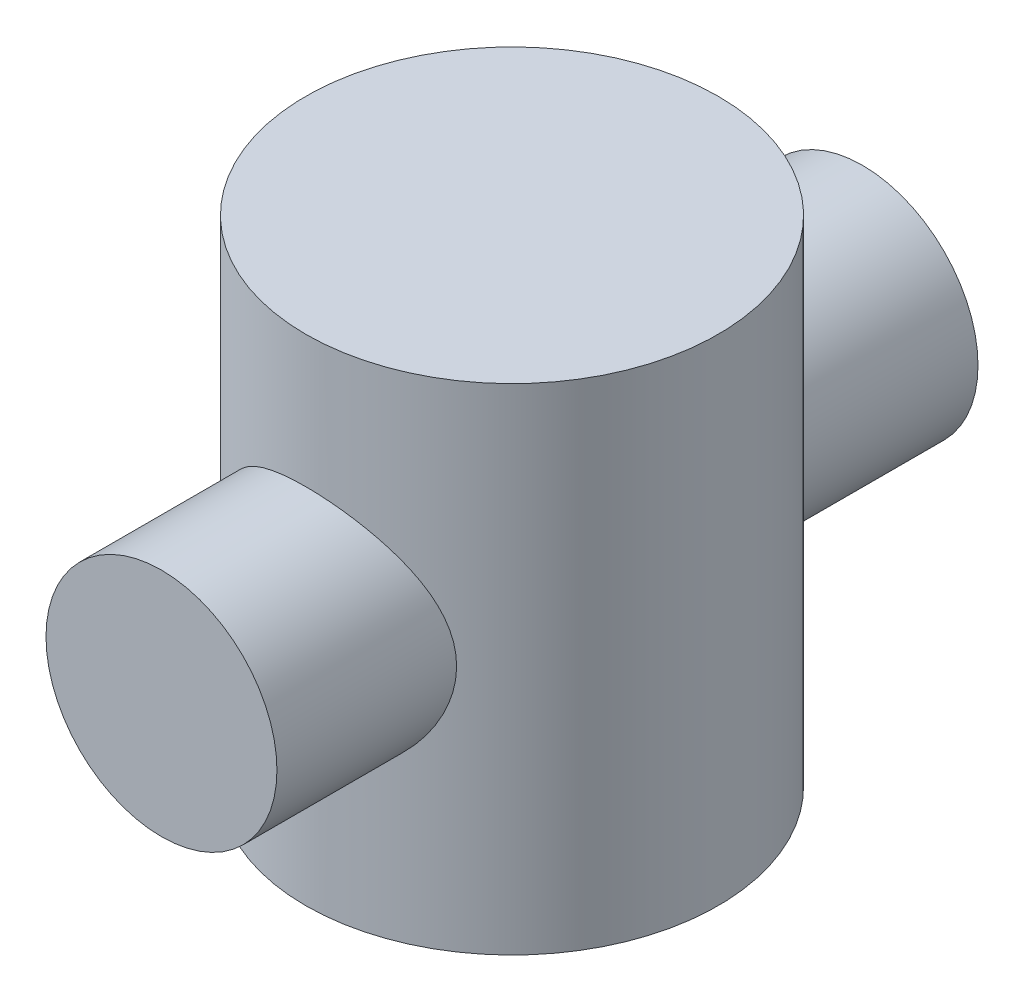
ISO-10303-21;
HEADER;
FILE_DESCRIPTION(('STEP AP214'),'2;1');
FILE_NAME('part.step','',(''),(''),'','','');
FILE_SCHEMA(('AUTOMOTIVE_DESIGN { 1 0 10303 214 1 1 1 1 }'));
ENDSEC;
DATA;
#1=APPLICATION_CONTEXT('core data for automotive mechanical design processes');
#2=APPLICATION_PROTOCOL_DEFINITION('international standard','automotive_design',2000,#1);
#3=PRODUCT_CONTEXT('',#1,'mechanical');
#4=PRODUCT('Part','Part','',(#3));
#5=PRODUCT_RELATED_PRODUCT_CATEGORY('part','',(#4));
#6=PRODUCT_DEFINITION_FORMATION('','',#4);
#7=PRODUCT_DEFINITION_CONTEXT('part definition',#1,'design');
#8=PRODUCT_DEFINITION('design','',#6,#7);
#9=PRODUCT_DEFINITION_SHAPE('','',#8);
#10=(LENGTH_UNIT() NAMED_UNIT(*) SI_UNIT(.MILLI.,.METRE.));
#11=(NAMED_UNIT(*) PLANE_ANGLE_UNIT() SI_UNIT($,.RADIAN.));
#12=(NAMED_UNIT(*) SI_UNIT($,.STERADIAN.) SOLID_ANGLE_UNIT());
#13=UNCERTAINTY_MEASURE_WITH_UNIT(LENGTH_MEASURE(1.E-05),#10,'distance_accuracy_value','');
#14=(GEOMETRIC_REPRESENTATION_CONTEXT(3) GLOBAL_UNCERTAINTY_ASSIGNED_CONTEXT((#13)) GLOBAL_UNIT_ASSIGNED_CONTEXT((#10,
#11,#12)) REPRESENTATION_CONTEXT('',''));
#15=CARTESIAN_POINT('',(0.,0.,0.));
#16=DIRECTION('',(0.,0.,1.));
#17=DIRECTION('',(1.,0.,0.));
#18=AXIS2_PLACEMENT_3D('',#15,#16,#17);
#19=CARTESIAN_POINT('',(0.,120.,0.));
#20=DIRECTION('',(0.,-1.,0.));
#21=DIRECTION('',(0.,0.,-1.));
#22=AXIS2_PLACEMENT_3D('',#19,#20,#21);
#23=CYLINDRICAL_SURFACE('',#22,50.);
#24=CARTESIAN_POINT('',(-28.,60.,41.424630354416));
#25=CARTESIAN_POINT('',(-27.9999924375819,59.2849118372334,41.4246407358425));
#26=CARTESIAN_POINT('',(-27.9725588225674,58.5696674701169,41.4432197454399));
#27=CARTESIAN_POINT('',(-27.8632461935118,57.1451396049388,41.5167879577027));
#28=CARTESIAN_POINT('',(-27.7813510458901,56.4358579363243,41.5717879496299));
#29=CARTESIAN_POINT('',(-27.5642480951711,55.0280623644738,41.7160542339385));
#30=CARTESIAN_POINT('',(-27.4289671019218,54.3295646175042,41.8053675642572));
#31=CARTESIAN_POINT('',(-27.1070201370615,52.9493467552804,42.0148334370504));
#32=CARTESIAN_POINT('',(-26.9203563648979,52.2676259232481,42.1349846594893));
#33=CARTESIAN_POINT('',(-26.499299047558,50.9293851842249,42.4010456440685));
#34=CARTESIAN_POINT('',(-26.2652244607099,50.2727300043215,42.5467824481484));
#35=CARTESIAN_POINT('',(-25.7509466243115,48.9831637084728,42.8599968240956));
#36=CARTESIAN_POINT('',(-25.4707430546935,48.3502527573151,43.0274745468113));
#37=CARTESIAN_POINT('',(-24.8664521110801,47.1106604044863,43.3795088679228));
#38=CARTESIAN_POINT('',(-24.5423608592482,46.5039813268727,43.5640669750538));
#39=CARTESIAN_POINT('',(-23.8524088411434,45.3189665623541,43.9456254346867));
#40=CARTESIAN_POINT('',(-23.4865457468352,44.7406324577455,44.1426264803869));
#41=CARTESIAN_POINT('',(-22.6743775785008,43.5548835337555,44.5657228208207));
#42=CARTESIAN_POINT('',(-22.2236593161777,42.9508022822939,44.792699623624));
#43=CARTESIAN_POINT('',(-21.2758566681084,41.7817607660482,45.2505794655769));
#44=CARTESIAN_POINT('',(-20.7787698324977,41.2168025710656,45.4814827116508));
#45=CARTESIAN_POINT('',(-19.7400942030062,40.1280340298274,45.9418275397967));
#46=CARTESIAN_POINT('',(-19.1984795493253,39.6042479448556,46.1712681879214));
#47=CARTESIAN_POINT('',(-18.0731575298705,38.6007156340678,46.623263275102));
#48=CARTESIAN_POINT('',(-17.4894484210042,38.1209712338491,46.8458174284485));
#49=CARTESIAN_POINT('',(-16.227780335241,37.1671385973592,47.2984962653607));
#50=CARTESIAN_POINT('',(-15.5460687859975,36.6974611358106,47.5274940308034));
#51=CARTESIAN_POINT('',(-14.1388297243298,35.8177328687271,47.9649496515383));
#52=CARTESIAN_POINT('',(-13.4132988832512,35.4076866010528,48.1734059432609));
#53=CARTESIAN_POINT('',(-11.92320980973,34.6517354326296,48.5636672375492));
#54=CARTESIAN_POINT('',(-11.1586754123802,34.3057919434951,48.7454882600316));
#55=CARTESIAN_POINT('',(-9.59559650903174,33.6820921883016,49.0771072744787));
#56=CARTESIAN_POINT('',(-8.79705674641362,33.4043264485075,49.2269097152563));
#57=CARTESIAN_POINT('',(-7.24208156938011,32.9416775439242,49.4784648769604));
#58=CARTESIAN_POINT('',(-6.4878919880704,32.7508795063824,49.5832327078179));
#59=CARTESIAN_POINT('',(-4.96243965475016,32.4322443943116,49.759053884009));
#60=CARTESIAN_POINT('',(-4.19117779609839,32.3044040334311,49.8301089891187));
#61=CARTESIAN_POINT('',(-2.63872833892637,32.1136530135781,49.9363802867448));
#62=CARTESIAN_POINT('',(-1.85754767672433,32.0506992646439,49.9716202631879));
#63=CARTESIAN_POINT('',(-0.291891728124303,31.9905667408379,50.0052766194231));
#64=CARTESIAN_POINT('',(0.492583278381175,31.9933824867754,50.0036960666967));
#65=CARTESIAN_POINT('',(1.97250673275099,32.0608355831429,49.9659517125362));
#66=CARTESIAN_POINT('',(2.66837180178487,32.118726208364,49.9335621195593));
#67=CARTESIAN_POINT('',(4.05190722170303,32.2859695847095,49.8403715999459));
#68=CARTESIAN_POINT('',(4.73957829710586,32.3953177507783,49.7795732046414));
#69=CARTESIAN_POINT('',(6.10206482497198,32.6641801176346,49.630983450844));
#70=CARTESIAN_POINT('',(6.77687980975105,32.8236961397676,49.5431911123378));
#71=CARTESIAN_POINT('',(8.10938655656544,33.1911292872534,49.3425969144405));
#72=CARTESIAN_POINT('',(8.76707764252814,33.3990483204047,49.2297940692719));
#73=CARTESIAN_POINT('',(10.0679294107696,33.8634644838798,48.9804016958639));
#74=CARTESIAN_POINT('',(10.7108835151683,34.1204193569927,48.843589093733));
#75=CARTESIAN_POINT('',(11.9721685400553,34.6791983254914,48.5498354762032));
#76=CARTESIAN_POINT('',(12.5904995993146,34.9810221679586,48.3928945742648));
#77=CARTESIAN_POINT('',(13.7998974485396,35.6272078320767,48.0620013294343));
#78=CARTESIAN_POINT('',(14.3909588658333,35.9715779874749,47.8880456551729));
#79=CARTESIAN_POINT('',(15.5433943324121,36.7004757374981,47.5264946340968));
#80=CARTESIAN_POINT('',(16.1047665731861,37.0850057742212,47.3388984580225));
#81=CARTESIAN_POINT('',(17.2560858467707,37.9365646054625,46.9322932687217));
#82=CARTESIAN_POINT('',(17.8423493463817,38.4080146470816,46.7121023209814));
#83=CARTESIAN_POINT('',(18.9735087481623,39.3949168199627,46.2641989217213));
#84=CARTESIAN_POINT('',(19.5184020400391,39.9103717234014,46.036485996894));
#85=CARTESIAN_POINT('',(20.5651976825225,40.9832984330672,45.5784965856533));
#86=CARTESIAN_POINT('',(21.0670557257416,41.5408124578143,45.3482177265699));
#87=CARTESIAN_POINT('',(22.0250305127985,42.6950699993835,44.890754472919));
#88=CARTESIAN_POINT('',(22.4811450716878,43.2918153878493,44.6635702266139));
#89=CARTESIAN_POINT('',(23.3856892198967,44.5797171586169,44.1971948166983));
#90=CARTESIAN_POINT('',(23.8294329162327,45.2744877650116,43.9588605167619));
#91=CARTESIAN_POINT('',(24.6562258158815,46.70514647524,43.5005066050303));
#92=CARTESIAN_POINT('',(25.0392696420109,47.4410382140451,43.2804886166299));
#93=CARTESIAN_POINT('',(25.7405735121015,48.9494821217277,42.8671029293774));
#94=CARTESIAN_POINT('',(26.0588928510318,49.7219999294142,42.6737108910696));
#95=CARTESIAN_POINT('',(26.6271043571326,51.2994411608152,42.3214989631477));
#96=CARTESIAN_POINT('',(26.877007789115,52.1043592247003,42.1626733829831));
#97=CARTESIAN_POINT('',(27.2873093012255,53.674834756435,41.8981805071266));
#98=CARTESIAN_POINT('',(27.4532671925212,54.4383918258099,41.7892777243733));
#99=CARTESIAN_POINT('',(27.7211704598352,55.9813456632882,41.6120497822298));
#100=CARTESIAN_POINT('',(27.823120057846,56.7607413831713,41.5437219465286));
#101=CARTESIAN_POINT('',(27.9610257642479,58.3271230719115,41.4510313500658));
#102=CARTESIAN_POINT('',(27.9970531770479,59.1140999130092,41.4266210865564));
#103=CARTESIAN_POINT('',(28.0025983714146,60.6883488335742,41.4228751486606));
#104=CARTESIAN_POINT('',(27.9721241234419,61.4756208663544,41.4435340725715));
#105=CARTESIAN_POINT('',(27.8550742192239,62.9219206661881,41.522267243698));
#106=CARTESIAN_POINT('',(27.7778336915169,63.5820744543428,41.5741077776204));
#107=CARTESIAN_POINT('',(27.5772600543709,64.8922158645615,41.7074243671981));
#108=CARTESIAN_POINT('',(27.4539327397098,65.5422047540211,41.7888966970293));
#109=CARTESIAN_POINT('',(27.1626465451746,66.8282951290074,41.9788134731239));
#110=CARTESIAN_POINT('',(26.9946704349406,67.4643911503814,42.087268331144));
#111=CARTESIAN_POINT('',(26.6159075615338,68.7191167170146,42.3278128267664));
#112=CARTESIAN_POINT('',(26.4051177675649,69.3377450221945,42.4599041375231));
#113=CARTESIAN_POINT('',(25.9333253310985,70.5792844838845,42.7497636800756));
#114=CARTESIAN_POINT('',(25.6706417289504,71.2013639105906,42.9083520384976));
#115=CARTESIAN_POINT('',(25.103122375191,72.4211863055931,43.2428225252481));
#116=CARTESIAN_POINT('',(24.7982820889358,73.0189266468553,43.4187065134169));
#117=CARTESIAN_POINT('',(24.1483547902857,74.1881815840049,43.7835109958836));
#118=CARTESIAN_POINT('',(23.803255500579,74.7596881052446,43.9724354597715));
#119=CARTESIAN_POINT('',(23.0746882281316,75.8745801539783,44.3590900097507));
#120=CARTESIAN_POINT('',(22.6912173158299,76.4179635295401,44.5568207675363));
#121=CARTESIAN_POINT('',(21.8209988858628,77.5625408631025,44.9901953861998));
#122=CARTESIAN_POINT('',(21.327663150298,78.1584154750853,45.2266971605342));
#123=CARTESIAN_POINT('',(20.2934847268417,79.3073028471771,45.7000868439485));
#124=CARTESIAN_POINT('',(19.7526376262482,79.8603116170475,45.9369747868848));
#125=CARTESIAN_POINT('',(18.6254176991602,80.921116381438,46.4054578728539));
#126=CARTESIAN_POINT('',(18.0390164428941,81.4288837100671,46.6370495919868));
#127=CARTESIAN_POINT('',(16.8234428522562,82.3958687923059,47.0891950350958));
#128=CARTESIAN_POINT('',(16.194270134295,82.8550861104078,47.3097486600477));
#129=CARTESIAN_POINT('',(14.859091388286,83.7463160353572,47.746498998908));
#130=CARTESIAN_POINT('',(14.1507518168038,84.1753124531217,47.9617406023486));
#131=CARTESIAN_POINT('',(12.6933096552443,84.97136966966,48.3678828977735));
#132=CARTESIAN_POINT('',(11.9442046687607,85.3384268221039,48.5587821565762));
#133=CARTESIAN_POINT('',(10.410843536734,86.0060161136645,48.9104530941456));
#134=CARTESIAN_POINT('',(9.62661825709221,86.3066053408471,49.071250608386));
#135=CARTESIAN_POINT('',(8.02854884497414,86.8374919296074,49.3578867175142));
#136=CARTESIAN_POINT('',(7.21470931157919,87.0678001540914,49.4837307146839));
#137=CARTESIAN_POINT('',(5.65004793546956,87.4345453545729,49.6853439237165));
#138=CARTESIAN_POINT('',(4.90141206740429,87.5782266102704,49.7649455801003));
#139=CARTESIAN_POINT('',(3.39214477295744,87.8042337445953,49.890545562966));
#140=CARTESIAN_POINT('',(2.63151418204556,87.8865638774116,49.9365462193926));
#141=CARTESIAN_POINT('',(1.10512348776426,87.9886322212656,49.9936170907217));
#142=CARTESIAN_POINT('',(0.339366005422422,88.0084002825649,50.0047039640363));
#143=CARTESIAN_POINT('',(-1.19087214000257,87.9851255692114,49.9916706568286));
#144=CARTESIAN_POINT('',(-1.95535287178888,87.9420862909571,49.9675524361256));
#145=CARTESIAN_POINT('',(-3.40431771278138,87.8008874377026,49.8887396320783));
#146=CARTESIAN_POINT('',(-4.0895270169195,87.7083284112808,49.837153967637));
#147=CARTESIAN_POINT('',(-5.4486774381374,87.4733955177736,49.706919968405));
#148=CARTESIAN_POINT('',(-6.12261944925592,87.3310256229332,49.6282737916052));
#149=CARTESIAN_POINT('',(-7.4549813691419,86.9980527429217,49.4456822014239));
#150=CARTESIAN_POINT('',(-8.11340040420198,86.8074470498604,49.3417353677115));
#151=CARTESIAN_POINT('',(-9.41087584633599,86.3799550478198,49.1107899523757));
#152=CARTESIAN_POINT('',(-10.049931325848,86.1430665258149,48.9837902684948));
#153=CARTESIAN_POINT('',(-11.3252270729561,85.6169862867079,48.7050167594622));
#154=CARTESIAN_POINT('',(-11.9607376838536,85.3263761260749,48.5525858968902));
#155=CARTESIAN_POINT('',(-13.2045314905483,84.7007088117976,48.2291749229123));
#156=CARTESIAN_POINT('',(-13.8128144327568,84.3656512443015,48.0581946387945));
#157=CARTESIAN_POINT('',(-14.9997374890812,83.6534788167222,47.7010704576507));
#158=CARTESIAN_POINT('',(-15.5783700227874,83.2763532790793,47.5149227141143));
#159=CARTESIAN_POINT('',(-16.7037856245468,82.4823882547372,47.1310620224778));
#160=CARTESIAN_POINT('',(-17.2505658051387,82.0655451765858,46.9333480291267));
#161=CARTESIAN_POINT('',(-18.076498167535,81.3866124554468,46.6191021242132));
#162=CARTESIAN_POINT('',(-18.3673217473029,81.1373586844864,46.5052266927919));
#163=CARTESIAN_POINT('',(-18.9380616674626,80.6275592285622,46.2757431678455));
#164=CARTESIAN_POINT('',(-19.217980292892,80.3670159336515,46.1601354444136));
#165=CARTESIAN_POINT('',(-20.0411166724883,79.5687992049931,45.8116639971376));
#166=CARTESIAN_POINT('',(-20.5677234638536,79.01453190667,45.5771487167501));
#167=CARTESIAN_POINT('',(-21.5747186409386,77.8638435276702,45.1092040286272));
#168=CARTESIAN_POINT('',(-22.0550487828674,77.2673709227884,44.8757763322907));
#169=CARTESIAN_POINT('',(-22.966475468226,76.0352168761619,44.4162297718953));
#170=CARTESIAN_POINT('',(-23.3975713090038,75.3995348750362,44.1901110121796));
#171=CARTESIAN_POINT('',(-24.2380668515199,74.0427687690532,43.7351251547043));
#172=CARTESIAN_POINT('',(-24.6434713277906,73.3188489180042,43.5073033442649));
#173=CARTESIAN_POINT('',(-25.3908898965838,71.8319502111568,43.0753894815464));
#174=CARTESIAN_POINT('',(-25.7328928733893,71.0689645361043,42.8713015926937));
#175=CARTESIAN_POINT('',(-26.3485945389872,69.5106047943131,42.4956631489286));
#176=CARTESIAN_POINT('',(-26.6224744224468,68.7153233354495,42.3240265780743));
#177=CARTESIAN_POINT('',(-27.0988974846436,67.0965140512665,42.0205891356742));
#178=CARTESIAN_POINT('',(-27.3014849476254,66.2730041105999,41.8887635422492));
#179=CARTESIAN_POINT('',(-27.5547674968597,64.9941077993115,41.7222438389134));
#180=CARTESIAN_POINT('',(-27.6322521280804,64.5459975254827,41.670912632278));
#181=CARTESIAN_POINT('',(-27.7654401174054,63.6451985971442,41.5822896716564));
#182=CARTESIAN_POINT('',(-27.8211469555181,63.1925106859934,41.544995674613));
#183=CARTESIAN_POINT('',(-27.9104263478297,62.2839605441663,41.4850695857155));
#184=CARTESIAN_POINT('',(-27.943997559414,61.8280981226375,41.4624383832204));
#185=CARTESIAN_POINT('',(-27.9887858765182,60.9148450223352,41.4322160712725));
#186=CARTESIAN_POINT('',(-28.0000048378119,60.4574544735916,41.4246237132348));
#187=CARTESIAN_POINT('',(-28.,60.,41.424630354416));
#188=B_SPLINE_CURVE_WITH_KNOTS('',3,(#24,#25,#26,#27,#28,#29,#30,#31,#32,#33,#34,#35,#36,#37,
#38,#39,#40,#41,#42,#43,#44,#45,#46,#47,#48,#49,#50,#51,#52,#53,#54,#55,#56,#57,#58,#59,#60,#61,
#62,#63,#64,#65,#66,#67,#68,#69,#70,#71,#72,#73,#74,#75,#76,#77,#78,#79,#80,#81,#82,#83,#84,#85,
#86,#87,#88,#89,#90,#91,#92,#93,#94,#95,#96,#97,#98,#99,#100,#101,#102,#103,#104,#105,#106,#107,
#108,#109,#110,#111,#112,#113,#114,#115,#116,#117,#118,#119,#120,#121,#122,#123,#124,#125,#126,
#127,#128,#129,#130,#131,#132,#133,#134,#135,#136,#137,#138,#139,#140,#141,#142,#143,#144,#145,
#146,#147,#148,#149,#150,#151,#152,#153,#154,#155,#156,#157,#158,#159,#160,#161,#162,#163,#164,
#165,#166,#167,#168,#169,#170,#171,#172,#173,#174,#175,#176,#177,#178,#179,#180,#181,#182,#183,
#184,#185,#186,#187),.UNSPECIFIED.,.T.,.F.,(4,2,2,2,2,2,2,2,2,2,2,2,2,2,2,2,2,2,2,2,2,2,2,2,2,2,
2,2,2,2,2,2,2,2,2,2,2,2,2,2,2,2,2,2,2,2,2,2,2,2,2,2,2,2,2,2,2,2,2,2,2,2,2,2,2,2,2,2,2,2,2,2,2,2,
2,2,2,2,2,2,2,4),(0.,2.14477776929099,4.29019118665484,6.43855616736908,8.58682920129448,
10.7211029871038,12.8553915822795,14.9898688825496,17.124465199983,19.4834460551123,
21.84255161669,24.2030370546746,26.563620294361,29.1370607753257,31.7106969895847,
34.2827788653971,36.8545031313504,39.2061210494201,41.557616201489,43.9075487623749,
46.2572855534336,48.3518525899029,50.4462330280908,52.5406895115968,54.6352285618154,
56.7503715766,58.8655026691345,60.981048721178,63.0967234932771,65.4458821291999,
67.7951888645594,70.1468860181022,72.4986954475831,75.0698896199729,77.641311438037,
80.2103668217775,82.7789989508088,85.1422045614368,87.5052542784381,89.8657464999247,
92.2259558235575,94.2236739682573,96.2211410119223,98.2193800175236,100.217760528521,
102.296659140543,104.375781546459,106.455539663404,108.535456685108,110.959661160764,
113.384091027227,115.81004629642,118.2360233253,120.799472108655,123.363071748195,
125.92446093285,128.485454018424,130.781621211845,133.077629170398,135.372541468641,
137.667326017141,139.744987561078,141.82248345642,143.900096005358,145.977807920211,
148.121298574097,150.264809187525,152.408865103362,154.553115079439,155.751609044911,
156.949850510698,159.346298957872,161.745725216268,164.145185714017,166.723019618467,
169.301305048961,171.87265757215,174.442410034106,175.814712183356,177.186794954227,
178.558960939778,179.931012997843),.UNSPECIFIED.);
#189=CARTESIAN_POINT('',(-28.,60.,41.424630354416));
#190=VERTEX_POINT('',#189);
#191=EDGE_CURVE('E39',#190,#190,#188,.T.);
#192=ORIENTED_EDGE('',*,*,#191,.F.);
#193=EDGE_LOOP('',(#192));
#194=FACE_BOUND('',#193,.T.);
#195=CARTESIAN_POINT('',(0.,120.,0.));
#196=DIRECTION('',(0.,1.,0.));
#197=DIRECTION('',(0.,0.,1.));
#198=AXIS2_PLACEMENT_3D('',#195,#196,#197);
#199=CIRCLE('',#198,50.);
#200=CARTESIAN_POINT('',(0.,120.,50.));
#201=VERTEX_POINT('',#200);
#202=EDGE_CURVE('E43',#201,#201,#199,.T.);
#203=ORIENTED_EDGE('',*,*,#202,.F.);
#204=EDGE_LOOP('',(#203));
#205=FACE_BOUND('',#204,.T.);
#206=CARTESIAN_POINT('',(0.,0.,0.));
#207=DIRECTION('',(0.,1.,0.));
#208=DIRECTION('',(0.,0.,1.));
#209=AXIS2_PLACEMENT_3D('',#206,#207,#208);
#210=CIRCLE('',#209,50.);
#211=CARTESIAN_POINT('',(0.,0.,50.));
#212=VERTEX_POINT('',#211);
#213=EDGE_CURVE('E47',#212,#212,#210,.T.);
#214=ORIENTED_EDGE('',*,*,#213,.T.);
#215=EDGE_LOOP('',(#214));
#216=FACE_BOUND('',#215,.T.);
#217=CARTESIAN_POINT('',(0.,88.,-50.));
#218=CARTESIAN_POINT('',(0.725789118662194,88.0000033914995,-50.0000029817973));
#219=CARTESIAN_POINT('',(1.45153575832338,87.9717506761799,-49.9841642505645));
#220=CARTESIAN_POINT('',(2.89724829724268,87.8591375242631,-49.921231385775));
#221=CARTESIAN_POINT('',(3.61721463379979,87.7747813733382,-49.8741396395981));
#222=CARTESIAN_POINT('',(5.04594931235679,87.5510678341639,-49.7499015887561));
#223=CARTESIAN_POINT('',(5.75471665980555,87.4117055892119,-49.6727526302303));
#224=CARTESIAN_POINT('',(7.15594832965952,87.0797132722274,-49.4903187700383));
#225=CARTESIAN_POINT('',(7.84841217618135,86.8870816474,-49.3850330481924));
#226=CARTESIAN_POINT('',(9.20994156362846,86.4515776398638,-49.1492887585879));
#227=CARTESIAN_POINT('',(9.87908556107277,86.2088976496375,-49.0189267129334));
#228=CARTESIAN_POINT('',(11.1928842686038,85.6753204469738,-48.7357257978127));
#229=CARTESIAN_POINT('',(11.83753920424,85.3844236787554,-48.5828871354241));
#230=CARTESIAN_POINT('',(13.0992393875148,84.756947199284,-48.2579982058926));
#231=CARTESIAN_POINT('',(13.7162810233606,84.4203615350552,-48.0859454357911));
#232=CARTESIAN_POINT('',(14.9200130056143,83.7040882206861,-47.7261762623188));
#233=CARTESIAN_POINT('',(15.5067019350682,83.3243985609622,-47.5384591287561));
#234=CARTESIAN_POINT('',(16.6875519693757,82.4962562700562,-47.1374712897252));
#235=CARTESIAN_POINT('',(17.2793451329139,82.044847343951,-46.92333181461));
#236=CARTESIAN_POINT('',(18.4232468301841,81.0982277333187,-46.4861159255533));
#237=CARTESIAN_POINT('',(18.9753538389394,80.6030153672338,-46.2630391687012));
#238=CARTESIAN_POINT('',(20.0382856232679,79.570806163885,-45.8126684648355));
#239=CARTESIAN_POINT('',(20.5490700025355,79.0337694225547,-45.5853706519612));
#240=CARTESIAN_POINT('',(21.5267247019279,77.9206281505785,-45.1319237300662));
#241=CARTESIAN_POINT('',(21.993592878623,77.344521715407,-44.9057746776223));
#242=CARTESIAN_POINT('',(22.9272591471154,76.0938237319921,-44.4369345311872));
#243=CARTESIAN_POINT('',(23.3890459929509,75.4152109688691,-44.1949547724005));
#244=CARTESIAN_POINT('',(24.2534189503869,74.0159890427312,-43.7265757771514));
#245=CARTESIAN_POINT('',(24.6559971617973,73.2953742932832,-43.5001786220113));
#246=CARTESIAN_POINT('',(25.3978852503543,71.816552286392,-43.0712303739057));
#247=CARTESIAN_POINT('',(25.7372696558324,71.0583906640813,-42.8686512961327));
#248=CARTESIAN_POINT('',(26.3493584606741,69.5081640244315,-42.4951769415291));
#249=CARTESIAN_POINT('',(26.6220835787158,68.7161096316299,-42.3242718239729));
#250=CARTESIAN_POINT('',(27.0462355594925,67.275874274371,-42.0541328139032));
#251=CARTESIAN_POINT('',(27.2111271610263,66.633039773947,-41.9473870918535));
#252=CARTESIAN_POINT('',(27.4953896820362,65.3334557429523,-41.7616149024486));
#253=CARTESIAN_POINT('',(27.6147671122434,64.6767082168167,-41.6825844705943));
#254=CARTESIAN_POINT('',(27.8064171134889,63.3540040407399,-41.5549812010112));
#255=CARTESIAN_POINT('',(27.8787301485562,62.6880558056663,-41.5063822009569));
#256=CARTESIAN_POINT('',(27.975412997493,61.3510893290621,-41.4412801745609));
#257=CARTESIAN_POINT('',(27.999781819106,60.6800709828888,-41.4247778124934));
#258=CARTESIAN_POINT('',(28.0002155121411,59.3372353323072,-41.4244847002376));
#259=CARTESIAN_POINT('',(27.9762244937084,58.6654180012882,-41.4407317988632));
#260=CARTESIAN_POINT('',(27.8801784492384,57.3268082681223,-41.5054088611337));
#261=CARTESIAN_POINT('',(27.8081232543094,56.6600158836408,-41.5538389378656));
#262=CARTESIAN_POINT('',(27.6169023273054,55.3358264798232,-41.6811689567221));
#263=CARTESIAN_POINT('',(27.4977103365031,54.678434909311,-41.7600858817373));
#264=CARTESIAN_POINT('',(27.213731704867,53.3776080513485,-41.9456971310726));
#265=CARTESIAN_POINT('',(27.0489439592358,52.7341731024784,-42.0523921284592));
#266=CARTESIAN_POINT('',(26.6757958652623,51.4654366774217,-42.2900783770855));
#267=CARTESIAN_POINT('',(26.467478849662,50.8401178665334,-42.4210454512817));
#268=CARTESIAN_POINT('',(26.0091363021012,49.6098217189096,-42.7035976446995));
#269=CARTESIAN_POINT('',(25.7591111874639,49.0048441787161,-42.8551825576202));
#270=CARTESIAN_POINT('',(25.2192244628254,47.817379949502,-43.1750987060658));
#271=CARTESIAN_POINT('',(24.9293534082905,47.2348986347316,-43.3434339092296));
#272=CARTESIAN_POINT('',(24.3116286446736,46.0944117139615,-43.692913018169));
#273=CARTESIAN_POINT('',(23.9837708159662,45.5364087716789,-43.8740583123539));
#274=CARTESIAN_POINT('',(23.2383302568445,44.3623771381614,-44.2739809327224));
#275=CARTESIAN_POINT('',(22.8147090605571,43.7506831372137,-44.4942516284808));
#276=CARTESIAN_POINT('',(21.9214186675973,42.5643220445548,-44.9410818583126));
#277=CARTESIAN_POINT('',(21.4517457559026,41.9896579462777,-45.167641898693));
#278=CARTESIAN_POINT('',(20.4681218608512,40.8791597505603,-45.6218106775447));
#279=CARTESIAN_POINT('',(19.9541382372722,40.3433548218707,-45.8494200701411));
#280=CARTESIAN_POINT('',(18.884249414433,39.3133725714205,-46.3003473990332));
#281=CARTESIAN_POINT('',(18.3283424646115,38.8191969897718,-46.5236651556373));
#282=CARTESIAN_POINT('',(17.1162371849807,37.8254358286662,-46.9840132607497));
#283=CARTESIAN_POINT('',(16.4556365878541,37.3307272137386,-47.2200224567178));
#284=CARTESIAN_POINT('',(15.0890270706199,36.3990426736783,-47.6743092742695));
#285=CARTESIAN_POINT('',(14.3830143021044,35.9620716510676,-47.8925853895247));
#286=CARTESIAN_POINT('',(12.9298720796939,35.1502383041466,-48.3051601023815));
#287=CARTESIAN_POINT('',(12.1827627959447,34.775345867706,-48.4994703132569));
#288=CARTESIAN_POINT('',(10.6520220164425,34.0917625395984,-48.8584908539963));
#289=CARTESIAN_POINT('',(9.86839500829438,33.7830635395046,-49.0232048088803));
#290=CARTESIAN_POINT('',(8.32691768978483,33.2553076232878,-49.3075322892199));
#291=CARTESIAN_POINT('',(7.57114065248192,33.0314675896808,-49.4295056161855));
#292=CARTESIAN_POINT('',(6.03895173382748,32.6475844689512,-49.6399921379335));
#293=CARTESIAN_POINT('',(5.2625406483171,32.4875389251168,-49.7285066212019));
#294=CARTESIAN_POINT('',(3.69630986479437,32.233721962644,-49.8693798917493));
#295=CARTESIAN_POINT('',(2.9065008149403,32.1399002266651,-49.9217661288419));
#296=CARTESIAN_POINT('',(1.32019789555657,32.0198363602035,-49.9888690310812));
#297=CARTESIAN_POINT('',(0.523704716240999,31.9935873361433,-50.0035895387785));
#298=CARTESIAN_POINT('',(-0.976193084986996,32.0081655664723,-49.9954286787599));
#299=CARTESIAN_POINT('',(-1.67970640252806,32.0415838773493,-49.976700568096));
#300=CARTESIAN_POINT('',(-3.08078317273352,32.1611246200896,-49.9099238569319));
#301=CARTESIAN_POINT('',(-3.77834717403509,32.2472421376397,-49.8618779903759));
#302=CARTESIAN_POINT('',(-5.16256080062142,32.47111385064,-49.7376208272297));
#303=CARTESIAN_POINT('',(-5.84921041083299,32.608868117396,-49.6614094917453));
#304=CARTESIAN_POINT('',(-7.20702674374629,32.9344089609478,-49.4826002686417));
#305=CARTESIAN_POINT('',(-7.87819297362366,33.1221971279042,-49.3800015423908));
#306=CARTESIAN_POINT('',(-9.19726890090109,33.5446179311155,-49.1513569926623));
#307=CARTESIAN_POINT('',(-9.84528666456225,33.77898582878,-49.0254439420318));
#308=CARTESIAN_POINT('',(-11.1184602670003,34.2929743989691,-48.7524743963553));
#309=CARTESIAN_POINT('',(-11.743616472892,34.572594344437,-48.605418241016));
#310=CARTESIAN_POINT('',(-12.9682360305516,35.174800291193,-48.29310778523));
#311=CARTESIAN_POINT('',(-13.567695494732,35.4973927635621,-48.1278507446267));
#312=CARTESIAN_POINT('',(-14.7383862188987,36.1831935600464,-47.7823454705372));
#313=CARTESIAN_POINT('',(-15.3096157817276,36.5464043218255,-47.6020963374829));
#314=CARTESIAN_POINT('',(-16.4793269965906,37.3507976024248,-47.2107023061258));
#315=CARTESIAN_POINT('',(-17.0745134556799,37.7961592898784,-46.998290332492));
#316=CARTESIAN_POINT('',(-18.2256080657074,38.7308442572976,-46.5639959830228));
#317=CARTESIAN_POINT('',(-18.7815138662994,39.2201701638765,-46.3421130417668));
#318=CARTESIAN_POINT('',(-19.852477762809,40.240778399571,-45.8935345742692));
#319=CARTESIAN_POINT('',(-20.36749275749,40.7721038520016,-45.6668342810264));
#320=CARTESIAN_POINT('',(-21.3540006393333,41.8739540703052,-45.2139502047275));
#321=CARTESIAN_POINT('',(-21.8254916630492,42.4444805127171,-44.9877664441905));
#322=CARTESIAN_POINT('',(-22.7694931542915,43.6838020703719,-44.5180435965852));
#323=CARTESIAN_POINT('',(-23.2370200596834,44.3566484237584,-44.275142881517));
#324=CARTESIAN_POINT('',(-24.1134067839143,45.7445710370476,-43.8040094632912));
#325=CARTESIAN_POINT('',(-24.5222587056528,46.459652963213,-43.5757787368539));
#326=CARTESIAN_POINT('',(-25.2772981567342,47.9277693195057,-43.1421786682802));
#327=CARTESIAN_POINT('',(-25.6235566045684,48.6807595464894,-42.9367835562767));
#328=CARTESIAN_POINT('',(-26.2500309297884,50.2211145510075,-42.5566718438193));
#329=CARTESIAN_POINT('',(-26.5302667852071,51.0084688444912,-42.3819459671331));
#330=CARTESIAN_POINT('',(-26.9692144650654,52.4435274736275,-42.1036105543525));
#331=CARTESIAN_POINT('',(-27.1410880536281,53.0858300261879,-41.9927720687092));
#332=CARTESIAN_POINT('',(-27.4393069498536,54.3849847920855,-41.7985191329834));
#333=CARTESIAN_POINT('',(-27.565658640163,55.0418349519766,-41.715100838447));
#334=CARTESIAN_POINT('',(-27.7711708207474,56.3654177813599,-41.5785682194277));
#335=CARTESIAN_POINT('',(-27.8503729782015,57.032141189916,-41.5254271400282));
#336=CARTESIAN_POINT('',(-27.9606679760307,58.37137019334,-41.451242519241));
#337=CARTESIAN_POINT('',(-27.9917599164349,59.0438758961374,-41.4301995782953));
#338=CARTESIAN_POINT('',(-28.0053842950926,60.3905791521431,-41.4209913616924));
#339=CARTESIAN_POINT('',(-27.9878465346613,61.0647777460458,-41.4328736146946));
#340=CARTESIAN_POINT('',(-27.9043208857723,62.408782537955,-41.4891718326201));
#341=CARTESIAN_POINT('',(-27.8383328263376,63.0785887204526,-41.5335879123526));
#342=CARTESIAN_POINT('',(-27.6587942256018,64.4093274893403,-41.6533635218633));
#343=CARTESIAN_POINT('',(-27.5452179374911,65.0702550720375,-41.7287398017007));
#344=CARTESIAN_POINT('',(-27.2719737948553,66.3785654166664,-41.9078281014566));
#345=CARTESIAN_POINT('',(-27.1123049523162,67.0259478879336,-42.0115407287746));
#346=CARTESIAN_POINT('',(-26.7499640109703,68.2990644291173,-42.2431682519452));
#347=CARTESIAN_POINT('',(-26.5475981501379,68.9249175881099,-42.3709101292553));
#348=CARTESIAN_POINT('',(-26.1011516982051,70.1567264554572,-42.647376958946));
#349=CARTESIAN_POINT('',(-25.8570716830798,70.7626824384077,-42.7961016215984));
#350=CARTESIAN_POINT('',(-25.3290640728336,71.9524998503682,-43.1107054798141));
#351=CARTESIAN_POINT('',(-25.0451273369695,72.5363561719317,-43.2765886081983));
#352=CARTESIAN_POINT('',(-24.4392590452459,73.6799651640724,-43.6216018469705));
#353=CARTESIAN_POINT('',(-24.1173233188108,74.2397151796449,-43.8007334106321));
#354=CARTESIAN_POINT('',(-23.3854720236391,75.416548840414,-44.196356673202));
#355=CARTESIAN_POINT('',(-22.9696202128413,76.0294297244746,-44.4143907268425));
#356=CARTESIAN_POINT('',(-22.0920623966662,77.2187997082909,-44.8573559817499));
#357=CARTESIAN_POINT('',(-21.6303527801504,77.7952859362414,-45.0822877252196));
#358=CARTESIAN_POINT('',(-20.6628408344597,78.9101056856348,-45.5338574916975));
#359=CARTESIAN_POINT('',(-20.1570059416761,79.448410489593,-45.7604966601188));
#360=CARTESIAN_POINT('',(-19.1035649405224,80.4841272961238,-46.2101920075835));
#361=CARTESIAN_POINT('',(-18.5559569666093,80.9815374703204,-46.433248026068));
#362=CARTESIAN_POINT('',(-17.3586614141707,81.9852727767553,-46.8949075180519));
#363=CARTESIAN_POINT('',(-16.7043681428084,82.4865763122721,-47.1325277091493));
#364=CARTESIAN_POINT('',(-15.3499988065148,83.4320207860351,-47.5908461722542));
#365=CARTESIAN_POINT('',(-14.649918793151,83.8761567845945,-47.8115429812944));
#366=CARTESIAN_POINT('',(-13.2081222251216,84.7029493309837,-48.2297478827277));
#367=CARTESIAN_POINT('',(-12.4664240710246,85.0856327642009,-48.4272661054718));
#368=CARTESIAN_POINT('',(-10.9458750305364,85.7854223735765,-48.7934325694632));
#369=CARTESIAN_POINT('',(-10.1670284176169,86.1025360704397,-48.9620841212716));
#370=CARTESIAN_POINT('',(-8.62943619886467,86.6487282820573,-49.2555092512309));
#371=CARTESIAN_POINT('',(-7.87265035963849,86.8821751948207,-49.3824157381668));
#372=CARTESIAN_POINT('',(-6.3373984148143,87.2849228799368,-49.6028079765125));
#373=CARTESIAN_POINT('',(-5.55893316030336,87.4542261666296,-49.6962950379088));
#374=CARTESIAN_POINT('',(-3.98754144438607,87.726067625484,-49.8469861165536));
#375=CARTESIAN_POINT('',(-3.1946261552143,87.8286553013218,-49.904217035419));
#376=CARTESIAN_POINT('',(-1.60112291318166,87.9656167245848,-49.9807207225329));
#377=CARTESIAN_POINT('',(-0.800535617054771,87.9999962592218,-49.9999967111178));
#378=CARTESIAN_POINT('',(0.,88.,-50.));
#379=B_SPLINE_CURVE_WITH_KNOTS('',3,(#217,#218,#219,#220,#221,#222,#223,#224,#225,#226,#227,
#228,#229,#230,#231,#232,#233,#234,#235,#236,#237,#238,#239,#240,#241,#242,#243,#244,#245,#246,
#247,#248,#249,#250,#251,#252,#253,#254,#255,#256,#257,#258,#259,#260,#261,#262,#263,#264,#265,
#266,#267,#268,#269,#270,#271,#272,#273,#274,#275,#276,#277,#278,#279,#280,#281,#282,#283,#284,
#285,#286,#287,#288,#289,#290,#291,#292,#293,#294,#295,#296,#297,#298,#299,#300,#301,#302,#303,
#304,#305,#306,#307,#308,#309,#310,#311,#312,#313,#314,#315,#316,#317,#318,#319,#320,#321,#322,
#323,#324,#325,#326,#327,#328,#329,#330,#331,#332,#333,#334,#335,#336,#337,#338,#339,#340,#341,
#342,#343,#344,#345,#346,#347,#348,#349,#350,#351,#352,#353,#354,#355,#356,#357,#358,#359,#360,
#361,#362,#363,#364,#365,#366,#367,#368,#369,#370,#371,#372,#373,#374,#375,#376,#377,#378),
.UNSPECIFIED.,.T.,.F.,(4,2,2,2,2,2,2,2,2,2,2,2,2,2,2,2,2,2,2,2,2,2,2,2,2,2,2,2,2,2,2,2,2,2,2,2,
2,2,2,2,2,2,2,2,2,2,2,2,2,2,2,2,2,2,2,2,2,2,2,2,2,2,2,2,2,2,2,2,2,2,2,2,2,2,2,2,2,2,2,2,4),(0.,
2.17657722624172,4.35298820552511,6.52959139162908,8.70625803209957,10.8747082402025,
13.0431384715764,15.2118515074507,17.3806656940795,19.7017671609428,22.0229577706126,
24.3463907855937,26.6699371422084,29.23403741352,31.7984795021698,34.3598777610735,
36.9204788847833,38.9349215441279,40.9490759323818,42.9614963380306,44.9739583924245,
46.9887475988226,49.0035438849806,51.0194641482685,53.0354332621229,55.0494049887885,
57.0633565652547,59.0777863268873,61.0924347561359,63.4179938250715,65.7437406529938,
68.0712155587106,70.3987877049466,72.9706775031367,75.5427855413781,78.1136422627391,
80.6841838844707,83.0736326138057,85.4629893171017,87.8505286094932,90.2378243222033,
92.3489255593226,94.4598299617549,96.5707372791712,98.6817116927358,100.781014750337,
102.880284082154,104.979869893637,107.079581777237,109.396536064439,111.713628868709,
114.033132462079,116.352735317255,118.913336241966,121.474281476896,124.032306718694,
126.589556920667,128.609704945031,130.629569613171,132.647646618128,134.665761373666,
136.686790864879,138.707827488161,140.729958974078,142.752133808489,144.760270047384,
146.768378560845,148.776948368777,150.785738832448,153.099598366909,155.413640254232,
157.72940454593,160.045272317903,162.615506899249,165.185963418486,167.755292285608,
170.324326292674,172.727144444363,175.1298683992,177.530807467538,179.931542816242),.UNSPECIFIED.);
#380=CARTESIAN_POINT('',(0.,88.,-50.));
#381=VERTEX_POINT('',#380);
#382=EDGE_CURVE('E10',#381,#381,#379,.T.);
#383=ORIENTED_EDGE('',*,*,#382,.F.);
#384=EDGE_LOOP('',(#383));
#385=FACE_BOUND('',#384,.T.);
#386=ADVANCED_FACE('F29',(#194,#205,#216,#385),#23,.T.);
#387=CARTESIAN_POINT('',(0.,120.,0.));
#388=DIRECTION('',(0.,1.,0.));
#389=DIRECTION('',(0.,0.,1.));
#390=AXIS2_PLACEMENT_3D('',#387,#388,#389);
#391=PLANE('',#390);
#392=ORIENTED_EDGE('',*,*,#202,.T.);
#393=EDGE_LOOP('',(#392));
#394=FACE_BOUND('',#393,.T.);
#395=ADVANCED_FACE('F61',(#394),#391,.T.);
#396=CARTESIAN_POINT('',(0.,0.,0.));
#397=DIRECTION('',(0.,1.,0.));
#398=DIRECTION('',(0.,0.,1.));
#399=AXIS2_PLACEMENT_3D('',#396,#397,#398);
#400=PLANE('',#399);
#401=ORIENTED_EDGE('',*,*,#213,.F.);
#402=EDGE_LOOP('',(#401));
#403=FACE_BOUND('',#402,.T.);
#404=ADVANCED_FACE('F64',(#403),#400,.F.);
#405=CARTESIAN_POINT('',(0.,60.,85.));
#406=DIRECTION('',(0.,0.,1.));
#407=DIRECTION('',(1.,0.,0.));
#408=AXIS2_PLACEMENT_3D('',#405,#406,#407);
#409=PLANE('',#408);
#410=CARTESIAN_POINT('',(0.,60.,85.));
#411=DIRECTION('',(0.,0.,1.));
#412=DIRECTION('',(1.,0.,0.));
#413=AXIS2_PLACEMENT_3D('',#410,#411,#412);
#414=CIRCLE('',#413,28.);
#415=CARTESIAN_POINT('',(28.,60.,85.));
#416=VERTEX_POINT('',#415);
#417=EDGE_CURVE('E83',#416,#416,#414,.T.);
#418=ORIENTED_EDGE('',*,*,#417,.T.);
#419=EDGE_LOOP('',(#418));
#420=FACE_BOUND('',#419,.T.);
#421=ADVANCED_FACE('F67',(#420),#409,.T.);
#422=CARTESIAN_POINT('',(0.,60.,85.));
#423=DIRECTION('',(0.,0.,-1.));
#424=DIRECTION('',(-1.,0.,0.));
#425=AXIS2_PLACEMENT_3D('',#422,#423,#424);
#426=CYLINDRICAL_SURFACE('',#425,28.);
#427=ORIENTED_EDGE('',*,*,#417,.F.);
#428=EDGE_LOOP('',(#427));
#429=FACE_BOUND('',#428,.T.);
#430=ORIENTED_EDGE('',*,*,#191,.T.);
#431=EDGE_LOOP('',(#430));
#432=FACE_BOUND('',#431,.T.);
#433=ADVANCED_FACE('F58',(#429,#432),#426,.T.);
#434=CARTESIAN_POINT('',(0.,60.,-85.));
#435=DIRECTION('',(0.,0.,1.));
#436=DIRECTION('',(1.,0.,0.));
#437=AXIS2_PLACEMENT_3D('',#434,#435,#436);
#438=CIRCLE('',#437,28.);
#439=CARTESIAN_POINT('',(28.,60.,-85.));
#440=VERTEX_POINT('',#439);
#441=EDGE_CURVE('E85',#440,#440,#438,.T.);
#442=ORIENTED_EDGE('',*,*,#441,.T.);
#443=EDGE_LOOP('',(#442));
#444=FACE_BOUND('',#443,.T.);
#445=ORIENTED_EDGE('',*,*,#382,.T.);
#446=EDGE_LOOP('',(#445));
#447=FACE_BOUND('',#446,.T.);
#448=ADVANCED_FACE('F52',(#444,#447),#426,.T.);
#449=CARTESIAN_POINT('',(0.,60.,-85.));
#450=DIRECTION('',(0.,0.,1.));
#451=DIRECTION('',(1.,0.,0.));
#452=AXIS2_PLACEMENT_3D('',#449,#450,#451);
#453=PLANE('',#452);
#454=ORIENTED_EDGE('',*,*,#441,.F.);
#455=EDGE_LOOP('',(#454));
#456=FACE_BOUND('',#455,.T.);
#457=ADVANCED_FACE('F57',(#456),#453,.F.);
#458=CLOSED_SHELL('',(#386,#395,#404,#421,#433,#448,#457));
#459=MANIFOLD_SOLID_BREP('B2',#458);
#460=ADVANCED_BREP_SHAPE_REPRESENTATION('',(#18,#459),#14);
#461=SHAPE_DEFINITION_REPRESENTATION(#9,#460);
ENDSEC;
END-ISO-10303-21;
